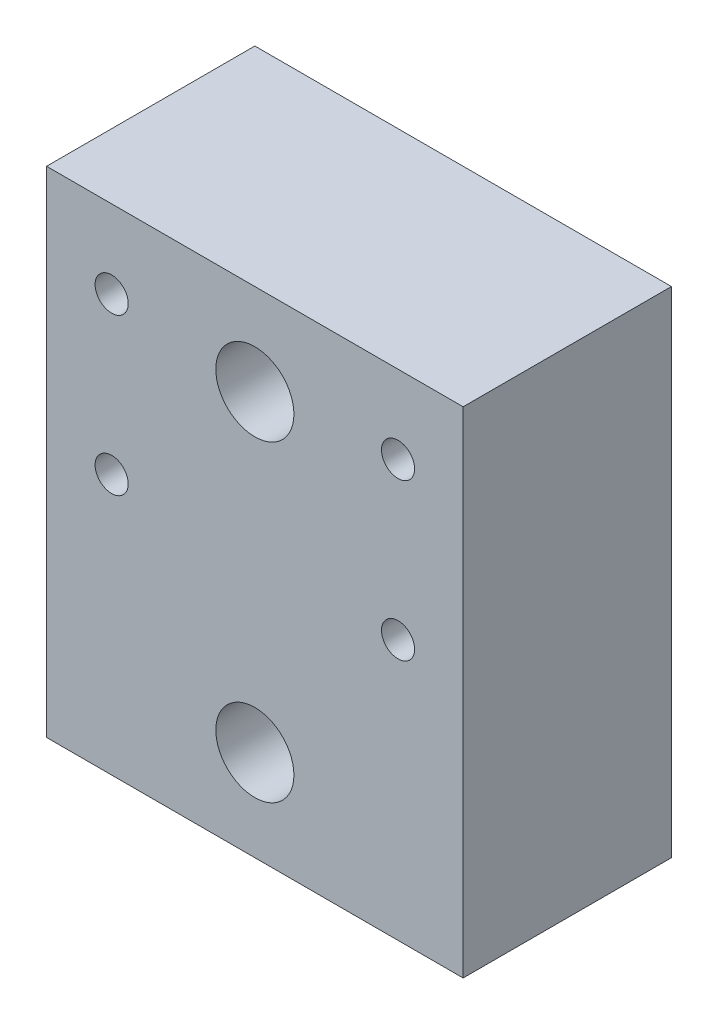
from build123d import *

# Parameters (mm, degrees)
SKETCH1_W                                       = 50.8
SKETCH1_H                                       = 60.325
BOSS_EXTRUDE1_DEPTH                             = 12.7
CBORE_FOR_10_SOCKET_HEAD_CAP_SCREW1_D           = 5.6134
CBORE_FOR_10_SOCKET_HEAD_CAP_SCREW1_CBORE_D     = 9.525
CBORE_FOR_10_SOCKET_HEAD_CAP_SCREW1_CBORE_DEPTH = 15.113
F_10_32_TAPPED_HOLE1_D                          = 4.0386


with BuildPart() as part:
    # Sketch1 → Boss-Extrude1 (new, symmetric)
    with BuildSketch(Plane.XY):
        Rectangle(SKETCH1_W, SKETCH1_H)
    extrude(amount=BOSS_EXTRUDE1_DEPTH, both=True)

    # CBORE for _10 Socket Head Cap Screw1 (through all)
    with Locations(Plane.XY.offset(12.7)):
        with Locations((0, 19.05), (0, -19.05)):
            CounterBoreHole(CBORE_FOR_10_SOCKET_HEAD_CAP_SCREW1_D / 2, CBORE_FOR_10_SOCKET_HEAD_CAP_SCREW1_CBORE_D / 2, CBORE_FOR_10_SOCKET_HEAD_CAP_SCREW1_CBORE_DEPTH)

    # 10-32 Tapped Hole1 (through all)
    with Locations(Plane.XY.offset(12.7)):
        with Locations((-17.4625, 20.6375), (17.4625, 20.6375), (17.4625, 1.5875), (-17.4625, 1.5875)):
            Hole(F_10_32_TAPPED_HOLE1_D / 2)


solid = part.part
